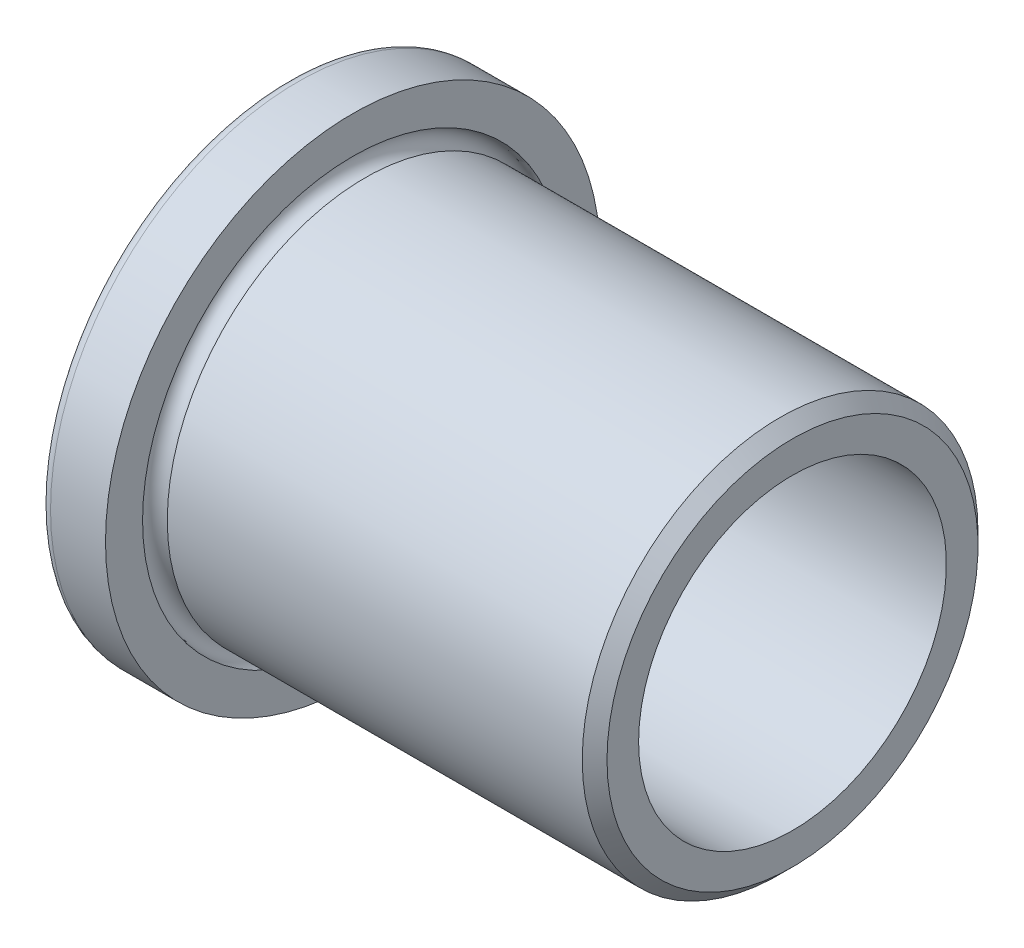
ISO-10303-21;
HEADER;
FILE_DESCRIPTION(('STEP AP214'),'2;1');
FILE_NAME('part.step','',(''),(''),'','','');
FILE_SCHEMA(('AUTOMOTIVE_DESIGN { 1 0 10303 214 1 1 1 1 }'));
ENDSEC;
DATA;
#1=APPLICATION_CONTEXT('core data for automotive mechanical design processes');
#2=APPLICATION_PROTOCOL_DEFINITION('international standard','automotive_design',2000,#1);
#3=PRODUCT_CONTEXT('',#1,'mechanical');
#4=PRODUCT('Part','Part','',(#3));
#5=PRODUCT_RELATED_PRODUCT_CATEGORY('part','',(#4));
#6=PRODUCT_DEFINITION_FORMATION('','',#4);
#7=PRODUCT_DEFINITION_CONTEXT('part definition',#1,'design');
#8=PRODUCT_DEFINITION('design','',#6,#7);
#9=PRODUCT_DEFINITION_SHAPE('','',#8);
#10=(LENGTH_UNIT() NAMED_UNIT(*) SI_UNIT(.MILLI.,.METRE.));
#11=(NAMED_UNIT(*) PLANE_ANGLE_UNIT() SI_UNIT($,.RADIAN.));
#12=(NAMED_UNIT(*) SI_UNIT($,.STERADIAN.) SOLID_ANGLE_UNIT());
#13=UNCERTAINTY_MEASURE_WITH_UNIT(LENGTH_MEASURE(1.E-05),#10,'distance_accuracy_value','');
#14=(GEOMETRIC_REPRESENTATION_CONTEXT(3) GLOBAL_UNCERTAINTY_ASSIGNED_CONTEXT((#13)) GLOBAL_UNIT_ASSIGNED_CONTEXT((#10,
#11,#12)) REPRESENTATION_CONTEXT('',''));
#15=CARTESIAN_POINT('',(0.,0.,0.));
#16=DIRECTION('',(0.,0.,1.));
#17=DIRECTION('',(1.,0.,0.));
#18=AXIS2_PLACEMENT_3D('',#15,#16,#17);
#19=CARTESIAN_POINT('',(9.525,35.7124,0.));
#20=DIRECTION('',(1.,0.,0.));
#21=DIRECTION('',(0.,0.,-1.));
#22=AXIS2_PLACEMENT_3D('',#19,#20,#21);
#23=PLANE('',#22);
#24=CARTESIAN_POINT('',(9.525,0.,0.));
#25=DIRECTION('',(-1.,0.,0.));
#26=DIRECTION('',(0.,0.,1.));
#27=AXIS2_PLACEMENT_3D('',#24,#25,#26);
#28=CIRCLE('',#27,30.35935);
#29=CARTESIAN_POINT('',(9.525,0.,30.35935));
#30=VERTEX_POINT('',#29);
#31=EDGE_CURVE('E65',#30,#30,#28,.T.);
#32=ORIENTED_EDGE('',*,*,#31,.T.);
#33=EDGE_LOOP('',(#32));
#34=FACE_BOUND('',#33,.T.);
#35=CARTESIAN_POINT('',(9.525,0.,0.));
#36=DIRECTION('',(-1.,0.,0.));
#37=DIRECTION('',(0.,0.,1.));
#38=AXIS2_PLACEMENT_3D('',#35,#36,#37);
#39=CIRCLE('',#38,35.7124);
#40=CARTESIAN_POINT('',(9.525,0.,35.7124));
#41=VERTEX_POINT('',#40);
#42=EDGE_CURVE('E10',#41,#41,#39,.T.);
#43=ORIENTED_EDGE('',*,*,#42,.F.);
#44=EDGE_LOOP('',(#43));
#45=FACE_BOUND('',#44,.T.);
#46=ADVANCED_FACE('F31',(#34,#45),#23,.T.);
#47=CARTESIAN_POINT('',(0.,0.,0.));
#48=DIRECTION('',(-1.,0.,0.));
#49=DIRECTION('',(0.,0.,1.));
#50=AXIS2_PLACEMENT_3D('',#47,#48,#49);
#51=CYLINDRICAL_SURFACE('',#50,35.7124);
#52=ORIENTED_EDGE('',*,*,#42,.T.);
#53=EDGE_LOOP('',(#52));
#54=FACE_BOUND('',#53,.T.);
#55=CARTESIAN_POINT('',(1.5875,0.,0.));
#56=DIRECTION('',(-1.,0.,0.));
#57=DIRECTION('',(0.,0.,1.));
#58=AXIS2_PLACEMENT_3D('',#55,#56,#57);
#59=CIRCLE('',#58,35.7124);
#60=CARTESIAN_POINT('',(1.5875,0.,35.7124));
#61=VERTEX_POINT('',#60);
#62=EDGE_CURVE('E37',#61,#61,#59,.T.);
#63=ORIENTED_EDGE('',*,*,#62,.F.);
#64=EDGE_LOOP('',(#63));
#65=FACE_BOUND('',#64,.T.);
#66=ADVANCED_FACE('F83',(#54,#65),#51,.T.);
#67=CARTESIAN_POINT('',(1.5875,0.,0.));
#68=DIRECTION('',(-1.,0.,0.));
#69=DIRECTION('',(0.,0.,1.));
#70=AXIS2_PLACEMENT_3D('',#67,#68,#69);
#71=TOROIDAL_SURFACE('',#70,34.1249,1.5875);
#72=CARTESIAN_POINT('',(0.,0.,0.));
#73=DIRECTION('',(-1.,0.,0.));
#74=DIRECTION('',(0.,0.,1.));
#75=AXIS2_PLACEMENT_3D('',#72,#73,#74);
#76=CIRCLE('',#75,34.1249);
#77=CARTESIAN_POINT('',(0.,0.,34.1249));
#78=VERTEX_POINT('',#77);
#79=EDGE_CURVE('E41',#78,#78,#76,.T.);
#80=ORIENTED_EDGE('',*,*,#79,.F.);
#81=EDGE_LOOP('',(#80));
#82=FACE_BOUND('',#81,.T.);
#83=ORIENTED_EDGE('',*,*,#62,.T.);
#84=EDGE_LOOP('',(#83));
#85=FACE_BOUND('',#84,.T.);
#86=ADVANCED_FACE('F87',(#82,#85),#71,.T.);
#87=CARTESIAN_POINT('',(0.,25.4,0.));
#88=DIRECTION('',(-1.,0.,0.));
#89=DIRECTION('',(0.,0.,1.));
#90=AXIS2_PLACEMENT_3D('',#87,#88,#89);
#91=PLANE('',#90);
#92=ORIENTED_EDGE('',*,*,#79,.T.);
#93=EDGE_LOOP('',(#92));
#94=FACE_BOUND('',#93,.T.);
#95=CARTESIAN_POINT('',(0.,0.,0.));
#96=DIRECTION('',(-1.,0.,0.));
#97=DIRECTION('',(0.,0.,1.));
#98=AXIS2_PLACEMENT_3D('',#95,#96,#97);
#99=CIRCLE('',#98,25.4);
#100=CARTESIAN_POINT('',(0.,0.,25.4));
#101=VERTEX_POINT('',#100);
#102=EDGE_CURVE('E45',#101,#101,#99,.T.);
#103=ORIENTED_EDGE('',*,*,#102,.F.);
#104=EDGE_LOOP('',(#103));
#105=FACE_BOUND('',#104,.T.);
#106=ADVANCED_FACE('F91',(#94,#105),#91,.T.);
#107=CARTESIAN_POINT('',(3.175,0.,0.));
#108=DIRECTION('',(-1.,0.,0.));
#109=DIRECTION('',(0.,0.,1.));
#110=AXIS2_PLACEMENT_3D('',#107,#108,#109);
#111=TOROIDAL_SURFACE('',#110,25.4,3.175);
#112=CARTESIAN_POINT('',(3.175,0.,0.));
#113=DIRECTION('',(-1.,0.,0.));
#114=DIRECTION('',(0.,0.,1.));
#115=AXIS2_PLACEMENT_3D('',#112,#113,#114);
#116=CIRCLE('',#115,22.225);
#117=CARTESIAN_POINT('',(3.175,0.,22.225));
#118=VERTEX_POINT('',#117);
#119=EDGE_CURVE('E50',#118,#118,#116,.T.);
#120=ORIENTED_EDGE('',*,*,#119,.F.);
#121=EDGE_LOOP('',(#120));
#122=FACE_BOUND('',#121,.T.);
#123=ORIENTED_EDGE('',*,*,#102,.T.);
#124=EDGE_LOOP('',(#123));
#125=FACE_BOUND('',#124,.T.);
#126=ADVANCED_FACE('F98',(#122,#125),#111,.T.);
#127=CARTESIAN_POINT('',(0.,0.,0.));
#128=DIRECTION('',(-1.,0.,0.));
#129=DIRECTION('',(0.,0.,1.));
#130=AXIS2_PLACEMENT_3D('',#127,#128,#129);
#131=CYLINDRICAL_SURFACE('',#130,22.225);
#132=ORIENTED_EDGE('',*,*,#119,.T.);
#133=EDGE_LOOP('',(#132));
#134=FACE_BOUND('',#133,.T.);
#135=CARTESIAN_POINT('',(73.025,0.,0.));
#136=DIRECTION('',(-1.,0.,0.));
#137=DIRECTION('',(0.,0.,1.));
#138=AXIS2_PLACEMENT_3D('',#135,#136,#137);
#139=CIRCLE('',#138,22.225);
#140=CARTESIAN_POINT('',(73.025,0.,22.225));
#141=VERTEX_POINT('',#140);
#142=EDGE_CURVE('E53',#141,#141,#139,.T.);
#143=ORIENTED_EDGE('',*,*,#142,.F.);
#144=EDGE_LOOP('',(#143));
#145=FACE_BOUND('',#144,.T.);
#146=ADVANCED_FACE('F102',(#134,#145),#131,.F.);
#147=CARTESIAN_POINT('',(73.025,26.7890625,0.));
#148=DIRECTION('',(1.,0.,0.));
#149=DIRECTION('',(0.,0.,-1.));
#150=AXIS2_PLACEMENT_3D('',#147,#148,#149);
#151=PLANE('',#150);
#152=ORIENTED_EDGE('',*,*,#142,.T.);
#153=EDGE_LOOP('',(#152));
#154=FACE_BOUND('',#153,.T.);
#155=CARTESIAN_POINT('',(73.025,0.,0.));
#156=DIRECTION('',(-1.,0.,0.));
#157=DIRECTION('',(0.,0.,1.));
#158=AXIS2_PLACEMENT_3D('',#155,#156,#157);
#159=CIRCLE('',#158,26.7890625);
#160=CARTESIAN_POINT('',(73.025,0.,26.7890625));
#161=VERTEX_POINT('',#160);
#162=EDGE_CURVE('E56',#161,#161,#159,.T.);
#163=ORIENTED_EDGE('',*,*,#162,.F.);
#164=EDGE_LOOP('',(#163));
#165=FACE_BOUND('',#164,.T.);
#166=ADVANCED_FACE('F106',(#154,#165),#151,.T.);
#167=CARTESIAN_POINT('',(71.2390625,0.,0.));
#168=DIRECTION('',(-1.,0.,0.));
#169=DIRECTION('',(0.,0.,1.));
#170=AXIS2_PLACEMENT_3D('',#167,#168,#169);
#171=CONICAL_SURFACE('',#170,28.575,0.785398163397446);
#172=ORIENTED_EDGE('',*,*,#162,.T.);
#173=EDGE_LOOP('',(#172));
#174=FACE_BOUND('',#173,.T.);
#175=CARTESIAN_POINT('',(71.2390625,0.,0.));
#176=DIRECTION('',(-1.,0.,0.));
#177=DIRECTION('',(0.,0.,1.));
#178=AXIS2_PLACEMENT_3D('',#175,#176,#177);
#179=CIRCLE('',#178,28.575);
#180=CARTESIAN_POINT('',(71.2390625,0.,28.575));
#181=VERTEX_POINT('',#180);
#182=EDGE_CURVE('E59',#181,#181,#179,.T.);
#183=ORIENTED_EDGE('',*,*,#182,.F.);
#184=EDGE_LOOP('',(#183));
#185=FACE_BOUND('',#184,.T.);
#186=ADVANCED_FACE('F79',(#174,#185),#171,.T.);
#187=CARTESIAN_POINT('',(0.,0.,0.));
#188=DIRECTION('',(-1.,0.,0.));
#189=DIRECTION('',(0.,0.,1.));
#190=AXIS2_PLACEMENT_3D('',#187,#188,#189);
#191=CYLINDRICAL_SURFACE('',#190,28.575);
#192=ORIENTED_EDGE('',*,*,#182,.T.);
#193=EDGE_LOOP('',(#192));
#194=FACE_BOUND('',#193,.T.);
#195=CARTESIAN_POINT('',(11.30935,0.,0.));
#196=DIRECTION('',(-1.,0.,0.));
#197=DIRECTION('',(0.,0.,1.));
#198=AXIS2_PLACEMENT_3D('',#195,#196,#197);
#199=CIRCLE('',#198,28.575);
#200=CARTESIAN_POINT('',(11.30935,0.,28.575));
#201=VERTEX_POINT('',#200);
#202=EDGE_CURVE('E62',#201,#201,#199,.T.);
#203=ORIENTED_EDGE('',*,*,#202,.F.);
#204=EDGE_LOOP('',(#203));
#205=FACE_BOUND('',#204,.T.);
#206=ADVANCED_FACE('F73',(#194,#205),#191,.T.);
#207=CARTESIAN_POINT('',(9.525,0.,0.));
#208=DIRECTION('',(-1.,0.,0.));
#209=DIRECTION('',(0.,0.,1.));
#210=AXIS2_PLACEMENT_3D('',#207,#208,#209);
#211=TOROIDAL_SURFACE('',#210,28.575,1.78435);
#212=ORIENTED_EDGE('',*,*,#202,.T.);
#213=EDGE_LOOP('',(#212));
#214=FACE_BOUND('',#213,.T.);
#215=ORIENTED_EDGE('',*,*,#31,.F.);
#216=EDGE_LOOP('',(#215));
#217=FACE_BOUND('',#216,.T.);
#218=ADVANCED_FACE('F71',(#214,#217),#211,.F.);
#219=CLOSED_SHELL('',(#46,#66,#86,#106,#126,#146,#166,#186,#206,#218));
#220=MANIFOLD_SOLID_BREP('B2',#219);
#221=ADVANCED_BREP_SHAPE_REPRESENTATION('',(#18,#220),#14);
#222=SHAPE_DEFINITION_REPRESENTATION(#9,#221);
ENDSEC;
END-ISO-10303-21;
